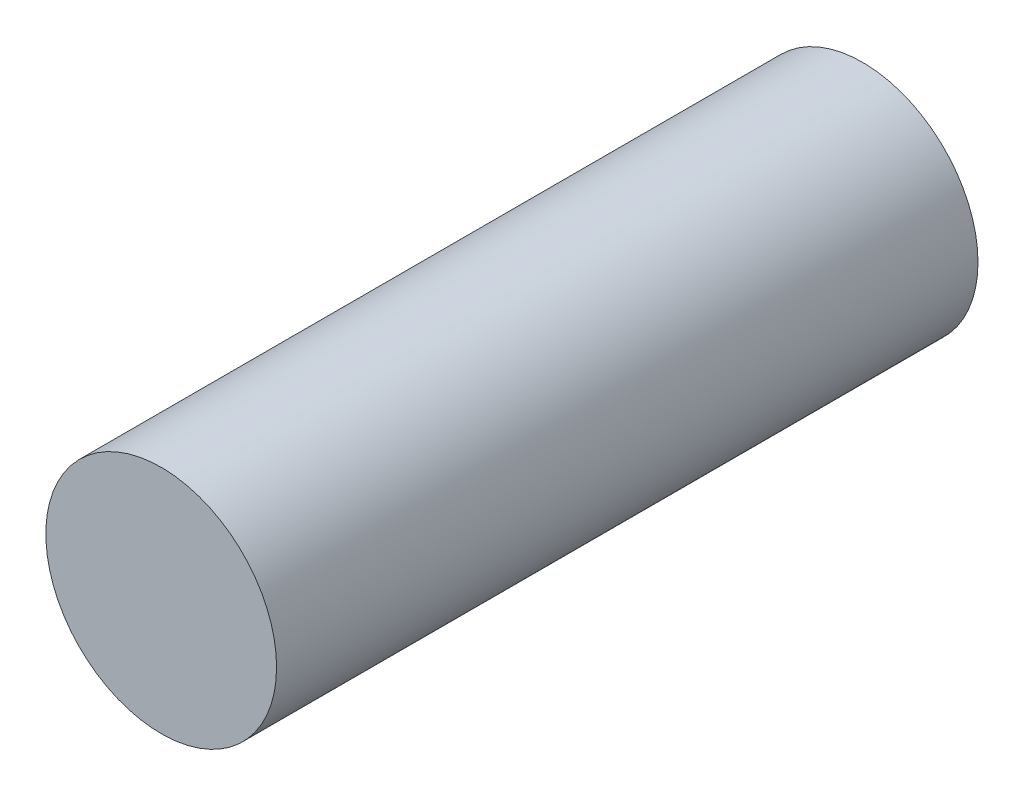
from build123d import *

# Parameters (mm, degrees)
SKETCH1_R      = 3.175
EXTRUDE1_DEPTH = 19.304


with BuildPart() as part:
    # Sketch1 → Extrude1 (new body)
    with BuildSketch(Plane.XY):
        Circle(SKETCH1_R)
    extrude(amount=EXTRUDE1_DEPTH)


solid = part.part
